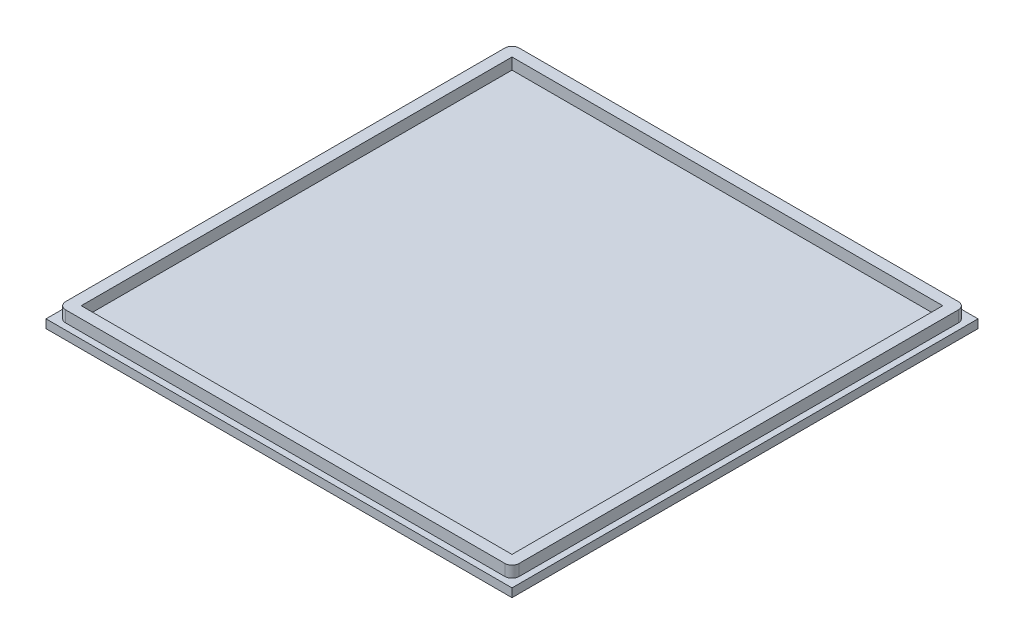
ISO-10303-21;
HEADER;
FILE_DESCRIPTION(('STEP AP214'),'2;1');
FILE_NAME('part.step','',(''),(''),'','','');
FILE_SCHEMA(('AUTOMOTIVE_DESIGN { 1 0 10303 214 1 1 1 1 }'));
ENDSEC;
DATA;
#1=APPLICATION_CONTEXT('core data for automotive mechanical design processes');
#2=APPLICATION_PROTOCOL_DEFINITION('international standard','automotive_design',2000,#1);
#3=PRODUCT_CONTEXT('',#1,'mechanical');
#4=PRODUCT('Part','Part','',(#3));
#5=PRODUCT_RELATED_PRODUCT_CATEGORY('part','',(#4));
#6=PRODUCT_DEFINITION_FORMATION('','',#4);
#7=PRODUCT_DEFINITION_CONTEXT('part definition',#1,'design');
#8=PRODUCT_DEFINITION('design','',#6,#7);
#9=PRODUCT_DEFINITION_SHAPE('','',#8);
#10=(LENGTH_UNIT() NAMED_UNIT(*) SI_UNIT(.MILLI.,.METRE.));
#11=(NAMED_UNIT(*) PLANE_ANGLE_UNIT() SI_UNIT($,.RADIAN.));
#12=(NAMED_UNIT(*) SI_UNIT($,.STERADIAN.) SOLID_ANGLE_UNIT());
#13=UNCERTAINTY_MEASURE_WITH_UNIT(LENGTH_MEASURE(1.E-05),#10,'distance_accuracy_value','');
#14=(GEOMETRIC_REPRESENTATION_CONTEXT(3) GLOBAL_UNCERTAINTY_ASSIGNED_CONTEXT((#13)) GLOBAL_UNIT_ASSIGNED_CONTEXT((#10,
#11,#12)) REPRESENTATION_CONTEXT('',''));
#15=CARTESIAN_POINT('',(0.,0.,0.));
#16=DIRECTION('',(0.,0.,1.));
#17=DIRECTION('',(1.,0.,0.));
#18=AXIS2_PLACEMENT_3D('',#15,#16,#17);
#19=CARTESIAN_POINT('',(0.,3.,0.));
#20=DIRECTION('',(0.,1.,0.));
#21=DIRECTION('',(0.,0.,1.));
#22=AXIS2_PLACEMENT_3D('',#19,#20,#21);
#23=PLANE('',#22);
#24=DIRECTION('',(0.,0.,-1.));
#25=VECTOR('',#24,1.);
#26=CARTESIAN_POINT('',(82.,3.,-82.));
#27=LINE('',#26,#25);
#28=CARTESIAN_POINT('',(82.,3.,82.));
#29=VERTEX_POINT('',#28);
#30=CARTESIAN_POINT('',(82.,3.,-82.));
#31=VERTEX_POINT('',#30);
#32=EDGE_CURVE('E327',#29,#31,#27,.T.);
#33=ORIENTED_EDGE('',*,*,#32,.T.);
#34=DIRECTION('',(-1.,0.,0.));
#35=VECTOR('',#34,1.);
#36=CARTESIAN_POINT('',(-82.,3.,-82.));
#37=LINE('',#36,#35);
#38=CARTESIAN_POINT('',(-82.,3.,-82.));
#39=VERTEX_POINT('',#38);
#40=EDGE_CURVE('E331',#31,#39,#37,.T.);
#41=ORIENTED_EDGE('',*,*,#40,.T.);
#42=DIRECTION('',(0.,0.,1.));
#43=VECTOR('',#42,1.);
#44=CARTESIAN_POINT('',(-82.,3.,-82.));
#45=LINE('',#44,#43);
#46=CARTESIAN_POINT('',(-82.,3.,82.));
#47=VERTEX_POINT('',#46);
#48=EDGE_CURVE('E335',#39,#47,#45,.T.);
#49=ORIENTED_EDGE('',*,*,#48,.T.);
#50=DIRECTION('',(1.,0.,0.));
#51=VECTOR('',#50,1.);
#52=CARTESIAN_POINT('',(-82.,3.,82.));
#53=LINE('',#52,#51);
#54=EDGE_CURVE('E338',#47,#29,#53,.T.);
#55=ORIENTED_EDGE('',*,*,#54,.T.);
#56=EDGE_LOOP('',(#33,#41,#49,#55));
#57=FACE_BOUND('',#56,.T.);
#58=DIRECTION('',(-1.,0.,0.));
#59=VECTOR('',#58,1.);
#60=CARTESIAN_POINT('',(-77.3,3.,-79.8));
#61=LINE('',#60,#59);
#62=CARTESIAN_POINT('',(77.3,3.,-79.8));
#63=VERTEX_POINT('',#62);
#64=CARTESIAN_POINT('',(-77.3,3.,-79.8));
#65=VERTEX_POINT('',#64);
#66=EDGE_CURVE('E278',#63,#65,#61,.T.);
#67=ORIENTED_EDGE('',*,*,#66,.F.);
#68=CARTESIAN_POINT('',(77.3,3.,-77.3));
#69=DIRECTION('',(0.,1.,0.));
#70=DIRECTION('',(0.,0.,1.));
#71=AXIS2_PLACEMENT_3D('',#68,#69,#70);
#72=CIRCLE('',#71,2.5);
#73=CARTESIAN_POINT('',(79.8,3.,-77.3));
#74=VERTEX_POINT('',#73);
#75=EDGE_CURVE('E216',#74,#63,#72,.T.);
#76=ORIENTED_EDGE('',*,*,#75,.F.);
#77=DIRECTION('',(0.,0.,-1.));
#78=VECTOR('',#77,1.);
#79=CARTESIAN_POINT('',(79.8,3.,77.3));
#80=LINE('',#79,#78);
#81=CARTESIAN_POINT('',(79.8,3.,77.3));
#82=VERTEX_POINT('',#81);
#83=EDGE_CURVE('E253',#82,#74,#80,.T.);
#84=ORIENTED_EDGE('',*,*,#83,.F.);
#85=CARTESIAN_POINT('',(77.3,3.,77.3));
#86=DIRECTION('',(0.,1.,0.));
#87=DIRECTION('',(0.,0.,1.));
#88=AXIS2_PLACEMENT_3D('',#85,#86,#87);
#89=CIRCLE('',#88,2.5);
#90=CARTESIAN_POINT('',(77.3,3.,79.8));
#91=VERTEX_POINT('',#90);
#92=EDGE_CURVE('E293',#91,#82,#89,.T.);
#93=ORIENTED_EDGE('',*,*,#92,.F.);
#94=DIRECTION('',(1.,0.,0.));
#95=VECTOR('',#94,1.);
#96=CARTESIAN_POINT('',(-77.3,3.,79.8));
#97=LINE('',#96,#95);
#98=CARTESIAN_POINT('',(-77.3,3.,79.8));
#99=VERTEX_POINT('',#98);
#100=EDGE_CURVE('E290',#99,#91,#97,.T.);
#101=ORIENTED_EDGE('',*,*,#100,.F.);
#102=CARTESIAN_POINT('',(-77.3,3.,77.3));
#103=DIRECTION('',(0.,1.,0.));
#104=DIRECTION('',(0.,0.,1.));
#105=AXIS2_PLACEMENT_3D('',#102,#103,#104);
#106=CIRCLE('',#105,2.50000000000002);
#107=CARTESIAN_POINT('',(-79.8,3.,77.3));
#108=VERTEX_POINT('',#107);
#109=EDGE_CURVE('E287',#108,#99,#106,.T.);
#110=ORIENTED_EDGE('',*,*,#109,.F.);
#111=DIRECTION('',(0.,0.,1.));
#112=VECTOR('',#111,1.);
#113=CARTESIAN_POINT('',(-79.8,3.,77.3));
#114=LINE('',#113,#112);
#115=CARTESIAN_POINT('',(-79.8,3.,-77.3));
#116=VERTEX_POINT('',#115);
#117=EDGE_CURVE('E284',#116,#108,#114,.T.);
#118=ORIENTED_EDGE('',*,*,#117,.F.);
#119=CARTESIAN_POINT('',(-77.3,3.,-77.3));
#120=DIRECTION('',(0.,1.,0.));
#121=DIRECTION('',(0.,0.,1.));
#122=AXIS2_PLACEMENT_3D('',#119,#120,#121);
#123=CIRCLE('',#122,2.5);
#124=EDGE_CURVE('E281',#65,#116,#123,.T.);
#125=ORIENTED_EDGE('',*,*,#124,.F.);
#126=EDGE_LOOP('',(#67,#76,#84,#93,#101,#110,#118,#125));
#127=FACE_BOUND('',#126,.T.);
#128=ADVANCED_FACE('F81',(#57,#127),#23,.T.);
#129=CARTESIAN_POINT('',(82.,3.,-82.));
#130=DIRECTION('',(-1.,0.,0.));
#131=DIRECTION('',(0.,0.,1.));
#132=AXIS2_PLACEMENT_3D('',#129,#130,#131);
#133=PLANE('',#132);
#134=DIRECTION('',(0.,0.,-1.));
#135=VECTOR('',#134,1.);
#136=CARTESIAN_POINT('',(82.,0.,-82.));
#137=LINE('',#136,#135);
#138=CARTESIAN_POINT('',(82.,0.,82.));
#139=VERTEX_POINT('',#138);
#140=CARTESIAN_POINT('',(82.,0.,-82.));
#141=VERTEX_POINT('',#140);
#142=EDGE_CURVE('E326',#139,#141,#137,.T.);
#143=ORIENTED_EDGE('',*,*,#142,.T.);
#144=DIRECTION('',(0.,-1.,0.));
#145=VECTOR('',#144,1.);
#146=CARTESIAN_POINT('',(82.,3.,-82.));
#147=LINE('',#146,#145);
#148=EDGE_CURVE('E12',#31,#141,#147,.T.);
#149=ORIENTED_EDGE('',*,*,#148,.F.);
#150=ORIENTED_EDGE('',*,*,#32,.F.);
#151=DIRECTION('',(0.,-1.,0.));
#152=VECTOR('',#151,1.);
#153=CARTESIAN_POINT('',(82.,3.,82.));
#154=LINE('',#153,#152);
#155=EDGE_CURVE('E341',#29,#139,#154,.T.);
#156=ORIENTED_EDGE('',*,*,#155,.T.);
#157=EDGE_LOOP('',(#143,#149,#150,#156));
#158=FACE_BOUND('',#157,.T.);
#159=ADVANCED_FACE('F83',(#158),#133,.F.);
#160=CARTESIAN_POINT('',(-82.,3.,-82.));
#161=DIRECTION('',(0.,0.,1.));
#162=DIRECTION('',(1.,0.,0.));
#163=AXIS2_PLACEMENT_3D('',#160,#161,#162);
#164=PLANE('',#163);
#165=DIRECTION('',(-1.,0.,0.));
#166=VECTOR('',#165,1.);
#167=CARTESIAN_POINT('',(-82.,0.,-82.));
#168=LINE('',#167,#166);
#169=CARTESIAN_POINT('',(-82.,0.,-82.));
#170=VERTEX_POINT('',#169);
#171=EDGE_CURVE('E345',#141,#170,#168,.T.);
#172=ORIENTED_EDGE('',*,*,#171,.T.);
#173=DIRECTION('',(0.,-1.,0.));
#174=VECTOR('',#173,1.);
#175=CARTESIAN_POINT('',(-82.,3.,-82.));
#176=LINE('',#175,#174);
#177=EDGE_CURVE('E90',#39,#170,#176,.T.);
#178=ORIENTED_EDGE('',*,*,#177,.F.);
#179=ORIENTED_EDGE('',*,*,#40,.F.);
#180=ORIENTED_EDGE('',*,*,#148,.T.);
#181=EDGE_LOOP('',(#172,#178,#179,#180));
#182=FACE_BOUND('',#181,.T.);
#183=ADVANCED_FACE('F381',(#182),#164,.F.);
#184=CARTESIAN_POINT('',(-82.,3.,-82.));
#185=DIRECTION('',(1.,0.,0.));
#186=DIRECTION('',(0.,0.,-1.));
#187=AXIS2_PLACEMENT_3D('',#184,#185,#186);
#188=PLANE('',#187);
#189=DIRECTION('',(0.,0.,1.));
#190=VECTOR('',#189,1.);
#191=CARTESIAN_POINT('',(-82.,0.,-82.));
#192=LINE('',#191,#190);
#193=CARTESIAN_POINT('',(-82.,0.,82.));
#194=VERTEX_POINT('',#193);
#195=EDGE_CURVE('E348',#170,#194,#192,.T.);
#196=ORIENTED_EDGE('',*,*,#195,.T.);
#197=DIRECTION('',(0.,-1.,0.));
#198=VECTOR('',#197,1.);
#199=CARTESIAN_POINT('',(-82.,3.,82.));
#200=LINE('',#199,#198);
#201=EDGE_CURVE('E356',#47,#194,#200,.T.);
#202=ORIENTED_EDGE('',*,*,#201,.F.);
#203=ORIENTED_EDGE('',*,*,#48,.F.);
#204=ORIENTED_EDGE('',*,*,#177,.T.);
#205=EDGE_LOOP('',(#196,#202,#203,#204));
#206=FACE_BOUND('',#205,.T.);
#207=ADVANCED_FACE('F365',(#206),#188,.F.);
#208=CARTESIAN_POINT('',(-82.,3.,82.));
#209=DIRECTION('',(0.,0.,-1.));
#210=DIRECTION('',(-1.,0.,0.));
#211=AXIS2_PLACEMENT_3D('',#208,#209,#210);
#212=PLANE('',#211);
#213=DIRECTION('',(1.,0.,0.));
#214=VECTOR('',#213,1.);
#215=CARTESIAN_POINT('',(-82.,0.,82.));
#216=LINE('',#215,#214);
#217=EDGE_CURVE('E332',#194,#139,#216,.T.);
#218=ORIENTED_EDGE('',*,*,#217,.T.);
#219=ORIENTED_EDGE('',*,*,#155,.F.);
#220=ORIENTED_EDGE('',*,*,#54,.F.);
#221=ORIENTED_EDGE('',*,*,#201,.T.);
#222=EDGE_LOOP('',(#218,#219,#220,#221));
#223=FACE_BOUND('',#222,.T.);
#224=ADVANCED_FACE('F374',(#223),#212,.F.);
#225=CARTESIAN_POINT('',(0.,0.,0.));
#226=DIRECTION('',(0.,1.,0.));
#227=DIRECTION('',(0.,0.,1.));
#228=AXIS2_PLACEMENT_3D('',#225,#226,#227);
#229=PLANE('',#228);
#230=ORIENTED_EDGE('',*,*,#142,.F.);
#231=ORIENTED_EDGE('',*,*,#217,.F.);
#232=ORIENTED_EDGE('',*,*,#195,.F.);
#233=ORIENTED_EDGE('',*,*,#171,.F.);
#234=EDGE_LOOP('',(#230,#231,#232,#233));
#235=FACE_BOUND('',#234,.T.);
#236=ADVANCED_FACE('F371',(#235),#229,.F.);
#237=CARTESIAN_POINT('',(77.3,7.,-77.3));
#238=DIRECTION('',(0.,1.,0.));
#239=DIRECTION('',(0.,0.,1.));
#240=AXIS2_PLACEMENT_3D('',#237,#238,#239);
#241=PLANE('',#240);
#242=CARTESIAN_POINT('',(77.3,7.,-77.3));
#243=DIRECTION('',(0.,1.,0.));
#244=DIRECTION('',(0.,0.,1.));
#245=AXIS2_PLACEMENT_3D('',#242,#243,#244);
#246=CIRCLE('',#245,2.5);
#247=CARTESIAN_POINT('',(79.8,7.,-77.3));
#248=VERTEX_POINT('',#247);
#249=CARTESIAN_POINT('',(77.3,7.,-79.8));
#250=VERTEX_POINT('',#249);
#251=EDGE_CURVE('E248',#248,#250,#246,.T.);
#252=ORIENTED_EDGE('',*,*,#251,.T.);
#253=DIRECTION('',(-1.,0.,0.));
#254=VECTOR('',#253,1.);
#255=CARTESIAN_POINT('',(-77.3,7.,-79.8));
#256=LINE('',#255,#254);
#257=CARTESIAN_POINT('',(-77.3,7.,-79.8));
#258=VERTEX_POINT('',#257);
#259=EDGE_CURVE('E252',#250,#258,#256,.T.);
#260=ORIENTED_EDGE('',*,*,#259,.T.);
#261=CARTESIAN_POINT('',(-77.3,7.,-77.3));
#262=DIRECTION('',(0.,1.,0.));
#263=DIRECTION('',(0.,0.,1.));
#264=AXIS2_PLACEMENT_3D('',#261,#262,#263);
#265=CIRCLE('',#264,2.5);
#266=CARTESIAN_POINT('',(-79.8,7.,-77.3));
#267=VERTEX_POINT('',#266);
#268=EDGE_CURVE('E256',#258,#267,#265,.T.);
#269=ORIENTED_EDGE('',*,*,#268,.T.);
#270=DIRECTION('',(0.,0.,1.));
#271=VECTOR('',#270,1.);
#272=CARTESIAN_POINT('',(-79.8,7.,77.3));
#273=LINE('',#272,#271);
#274=CARTESIAN_POINT('',(-79.8,7.,77.3));
#275=VERTEX_POINT('',#274);
#276=EDGE_CURVE('E259',#267,#275,#273,.T.);
#277=ORIENTED_EDGE('',*,*,#276,.T.);
#278=CARTESIAN_POINT('',(-77.3,7.,77.3));
#279=DIRECTION('',(0.,1.,0.));
#280=DIRECTION('',(0.,0.,1.));
#281=AXIS2_PLACEMENT_3D('',#278,#279,#280);
#282=CIRCLE('',#281,2.50000000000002);
#283=CARTESIAN_POINT('',(-77.3,7.,79.8));
#284=VERTEX_POINT('',#283);
#285=EDGE_CURVE('E262',#275,#284,#282,.T.);
#286=ORIENTED_EDGE('',*,*,#285,.T.);
#287=DIRECTION('',(1.,0.,0.));
#288=VECTOR('',#287,1.);
#289=CARTESIAN_POINT('',(-77.3,7.,79.8));
#290=LINE('',#289,#288);
#291=CARTESIAN_POINT('',(77.3,7.,79.8));
#292=VERTEX_POINT('',#291);
#293=EDGE_CURVE('E265',#284,#292,#290,.T.);
#294=ORIENTED_EDGE('',*,*,#293,.T.);
#295=CARTESIAN_POINT('',(77.3,7.,77.3));
#296=DIRECTION('',(0.,1.,0.));
#297=DIRECTION('',(0.,0.,1.));
#298=AXIS2_PLACEMENT_3D('',#295,#296,#297);
#299=CIRCLE('',#298,2.5);
#300=CARTESIAN_POINT('',(79.8,7.,77.3));
#301=VERTEX_POINT('',#300);
#302=EDGE_CURVE('E268',#292,#301,#299,.T.);
#303=ORIENTED_EDGE('',*,*,#302,.T.);
#304=DIRECTION('',(0.,0.,-1.));
#305=VECTOR('',#304,1.);
#306=CARTESIAN_POINT('',(79.8,7.,77.3));
#307=LINE('',#306,#305);
#308=EDGE_CURVE('E271',#301,#248,#307,.T.);
#309=ORIENTED_EDGE('',*,*,#308,.T.);
#310=EDGE_LOOP('',(#252,#260,#269,#277,#286,#294,#303,#309));
#311=FACE_BOUND('',#310,.T.);
#312=DIRECTION('',(0.,0.,1.));
#313=VECTOR('',#312,1.);
#314=CARTESIAN_POINT('',(-75.8,7.,77.3));
#315=LINE('',#314,#313);
#316=CARTESIAN_POINT('',(-75.8,7.,-75.8));
#317=VERTEX_POINT('',#316);
#318=CARTESIAN_POINT('',(-75.8,7.,75.8));
#319=VERTEX_POINT('',#318);
#320=EDGE_CURVE('E207',#317,#319,#315,.T.);
#321=ORIENTED_EDGE('',*,*,#320,.F.);
#322=DIRECTION('',(-1.,0.,0.));
#323=VECTOR('',#322,1.);
#324=CARTESIAN_POINT('',(-77.3,7.,-75.8));
#325=LINE('',#324,#323);
#326=CARTESIAN_POINT('',(75.8,7.,-75.8));
#327=VERTEX_POINT('',#326);
#328=EDGE_CURVE('E197',#327,#317,#325,.T.);
#329=ORIENTED_EDGE('',*,*,#328,.F.);
#330=DIRECTION('',(0.,0.,-1.));
#331=VECTOR('',#330,1.);
#332=CARTESIAN_POINT('',(75.8,7.,77.3));
#333=LINE('',#332,#331);
#334=CARTESIAN_POINT('',(75.8,7.,75.8));
#335=VERTEX_POINT('',#334);
#336=EDGE_CURVE('E226',#335,#327,#333,.T.);
#337=ORIENTED_EDGE('',*,*,#336,.F.);
#338=DIRECTION('',(1.,0.,0.));
#339=VECTOR('',#338,1.);
#340=CARTESIAN_POINT('',(-77.3,7.,75.8));
#341=LINE('',#340,#339);
#342=EDGE_CURVE('E222',#319,#335,#341,.T.);
#343=ORIENTED_EDGE('',*,*,#342,.F.);
#344=EDGE_LOOP('',(#321,#329,#337,#343));
#345=FACE_BOUND('',#344,.T.);
#346=ADVANCED_FACE('F220',(#311,#345),#241,.T.);
#347=CARTESIAN_POINT('',(77.3,7.,-77.3));
#348=DIRECTION('',(0.,-1.,0.));
#349=DIRECTION('',(0.,0.,-1.));
#350=AXIS2_PLACEMENT_3D('',#347,#348,#349);
#351=CYLINDRICAL_SURFACE('',#350,2.5);
#352=ORIENTED_EDGE('',*,*,#75,.T.);
#353=DIRECTION('',(0.,-1.,0.));
#354=VECTOR('',#353,1.);
#355=CARTESIAN_POINT('',(77.3,7.,-79.8));
#356=LINE('',#355,#354);
#357=EDGE_CURVE('E323',#250,#63,#356,.T.);
#358=ORIENTED_EDGE('',*,*,#357,.F.);
#359=ORIENTED_EDGE('',*,*,#251,.F.);
#360=DIRECTION('',(0.,-1.,0.));
#361=VECTOR('',#360,1.);
#362=CARTESIAN_POINT('',(79.8,7.,-77.3));
#363=LINE('',#362,#361);
#364=EDGE_CURVE('E274',#248,#74,#363,.T.);
#365=ORIENTED_EDGE('',*,*,#364,.T.);
#366=EDGE_LOOP('',(#352,#358,#359,#365));
#367=FACE_BOUND('',#366,.T.);
#368=ADVANCED_FACE('F418',(#367),#351,.T.);
#369=CARTESIAN_POINT('',(-77.3,7.,-79.8));
#370=DIRECTION('',(0.,0.,1.));
#371=DIRECTION('',(1.,0.,0.));
#372=AXIS2_PLACEMENT_3D('',#369,#370,#371);
#373=PLANE('',#372);
#374=ORIENTED_EDGE('',*,*,#66,.T.);
#375=DIRECTION('',(0.,-1.,0.));
#376=VECTOR('',#375,1.);
#377=CARTESIAN_POINT('',(-77.3,7.,-79.8));
#378=LINE('',#377,#376);
#379=EDGE_CURVE('E319',#258,#65,#378,.T.);
#380=ORIENTED_EDGE('',*,*,#379,.F.);
#381=ORIENTED_EDGE('',*,*,#259,.F.);
#382=ORIENTED_EDGE('',*,*,#357,.T.);
#383=EDGE_LOOP('',(#374,#380,#381,#382));
#384=FACE_BOUND('',#383,.T.);
#385=ADVANCED_FACE('F441',(#384),#373,.F.);
#386=CARTESIAN_POINT('',(-77.3,7.,-77.3));
#387=DIRECTION('',(0.,-1.,0.));
#388=DIRECTION('',(0.,0.,-1.));
#389=AXIS2_PLACEMENT_3D('',#386,#387,#388);
#390=CYLINDRICAL_SURFACE('',#389,2.5);
#391=ORIENTED_EDGE('',*,*,#124,.T.);
#392=DIRECTION('',(0.,-1.,0.));
#393=VECTOR('',#392,1.);
#394=CARTESIAN_POINT('',(-79.8,7.,-77.3));
#395=LINE('',#394,#393);
#396=EDGE_CURVE('E315',#267,#116,#395,.T.);
#397=ORIENTED_EDGE('',*,*,#396,.F.);
#398=ORIENTED_EDGE('',*,*,#268,.F.);
#399=ORIENTED_EDGE('',*,*,#379,.T.);
#400=EDGE_LOOP('',(#391,#397,#398,#399));
#401=FACE_BOUND('',#400,.T.);
#402=ADVANCED_FACE('F437',(#401),#390,.T.);
#403=CARTESIAN_POINT('',(-79.8,7.,77.3));
#404=DIRECTION('',(1.,0.,0.));
#405=DIRECTION('',(0.,0.,-1.));
#406=AXIS2_PLACEMENT_3D('',#403,#404,#405);
#407=PLANE('',#406);
#408=ORIENTED_EDGE('',*,*,#117,.T.);
#409=DIRECTION('',(0.,-1.,0.));
#410=VECTOR('',#409,1.);
#411=CARTESIAN_POINT('',(-79.8,7.,77.3));
#412=LINE('',#411,#410);
#413=EDGE_CURVE('E311',#275,#108,#412,.T.);
#414=ORIENTED_EDGE('',*,*,#413,.F.);
#415=ORIENTED_EDGE('',*,*,#276,.F.);
#416=ORIENTED_EDGE('',*,*,#396,.T.);
#417=EDGE_LOOP('',(#408,#414,#415,#416));
#418=FACE_BOUND('',#417,.T.);
#419=ADVANCED_FACE('F433',(#418),#407,.F.);
#420=CARTESIAN_POINT('',(-77.3,7.,77.3));
#421=DIRECTION('',(0.,-1.,0.));
#422=DIRECTION('',(0.,0.,-1.));
#423=AXIS2_PLACEMENT_3D('',#420,#421,#422);
#424=CYLINDRICAL_SURFACE('',#423,2.50000000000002);
#425=ORIENTED_EDGE('',*,*,#109,.T.);
#426=DIRECTION('',(0.,-1.,0.));
#427=VECTOR('',#426,1.);
#428=CARTESIAN_POINT('',(-77.3,7.,79.8));
#429=LINE('',#428,#427);
#430=EDGE_CURVE('E307',#284,#99,#429,.T.);
#431=ORIENTED_EDGE('',*,*,#430,.F.);
#432=ORIENTED_EDGE('',*,*,#285,.F.);
#433=ORIENTED_EDGE('',*,*,#413,.T.);
#434=EDGE_LOOP('',(#425,#431,#432,#433));
#435=FACE_BOUND('',#434,.T.);
#436=ADVANCED_FACE('F429',(#435),#424,.T.);
#437=CARTESIAN_POINT('',(-77.3,7.,79.8));
#438=DIRECTION('',(0.,0.,-1.));
#439=DIRECTION('',(-1.,0.,0.));
#440=AXIS2_PLACEMENT_3D('',#437,#438,#439);
#441=PLANE('',#440);
#442=ORIENTED_EDGE('',*,*,#100,.T.);
#443=DIRECTION('',(0.,-1.,0.));
#444=VECTOR('',#443,1.);
#445=CARTESIAN_POINT('',(77.3,7.,79.8));
#446=LINE('',#445,#444);
#447=EDGE_CURVE('E303',#292,#91,#446,.T.);
#448=ORIENTED_EDGE('',*,*,#447,.F.);
#449=ORIENTED_EDGE('',*,*,#293,.F.);
#450=ORIENTED_EDGE('',*,*,#430,.T.);
#451=EDGE_LOOP('',(#442,#448,#449,#450));
#452=FACE_BOUND('',#451,.T.);
#453=ADVANCED_FACE('F425',(#452),#441,.F.);
#454=CARTESIAN_POINT('',(77.3,7.,77.3));
#455=DIRECTION('',(0.,-1.,0.));
#456=DIRECTION('',(0.,0.,-1.));
#457=AXIS2_PLACEMENT_3D('',#454,#455,#456);
#458=CYLINDRICAL_SURFACE('',#457,2.5);
#459=ORIENTED_EDGE('',*,*,#92,.T.);
#460=DIRECTION('',(0.,-1.,0.));
#461=VECTOR('',#460,1.);
#462=CARTESIAN_POINT('',(79.8,7.,77.3));
#463=LINE('',#462,#461);
#464=EDGE_CURVE('E97',#301,#82,#463,.T.);
#465=ORIENTED_EDGE('',*,*,#464,.F.);
#466=ORIENTED_EDGE('',*,*,#302,.F.);
#467=ORIENTED_EDGE('',*,*,#447,.T.);
#468=EDGE_LOOP('',(#459,#465,#466,#467));
#469=FACE_BOUND('',#468,.T.);
#470=ADVANCED_FACE('F422',(#469),#458,.T.);
#471=CARTESIAN_POINT('',(79.8,7.,77.3));
#472=DIRECTION('',(-1.,0.,0.));
#473=DIRECTION('',(0.,0.,1.));
#474=AXIS2_PLACEMENT_3D('',#471,#472,#473);
#475=PLANE('',#474);
#476=ORIENTED_EDGE('',*,*,#83,.T.);
#477=ORIENTED_EDGE('',*,*,#364,.F.);
#478=ORIENTED_EDGE('',*,*,#308,.F.);
#479=ORIENTED_EDGE('',*,*,#464,.T.);
#480=EDGE_LOOP('',(#476,#477,#478,#479));
#481=FACE_BOUND('',#480,.T.);
#482=ADVANCED_FACE('F416',(#481),#475,.F.);
#483=CARTESIAN_POINT('',(-77.3,7.,-75.8));
#484=DIRECTION('',(0.,0.,1.));
#485=DIRECTION('',(1.,0.,0.));
#486=AXIS2_PLACEMENT_3D('',#483,#484,#485);
#487=PLANE('',#486);
#488=DIRECTION('',(-1.,0.,0.));
#489=VECTOR('',#488,1.);
#490=CARTESIAN_POINT('',(-77.3,3.,-75.8));
#491=LINE('',#490,#489);
#492=CARTESIAN_POINT('',(75.8,3.,-75.8));
#493=VERTEX_POINT('',#492);
#494=CARTESIAN_POINT('',(-75.8,3.,-75.8));
#495=VERTEX_POINT('',#494);
#496=EDGE_CURVE('E105',#493,#495,#491,.T.);
#497=ORIENTED_EDGE('',*,*,#496,.F.);
#498=DIRECTION('',(0.,-1.,0.));
#499=VECTOR('',#498,1.);
#500=CARTESIAN_POINT('',(75.8,7.,-75.8));
#501=LINE('',#500,#499);
#502=EDGE_CURVE('E202',#327,#493,#501,.T.);
#503=ORIENTED_EDGE('',*,*,#502,.F.);
#504=ORIENTED_EDGE('',*,*,#328,.T.);
#505=DIRECTION('',(0.,-1.,0.));
#506=VECTOR('',#505,1.);
#507=CARTESIAN_POINT('',(-75.8,7.,-75.8));
#508=LINE('',#507,#506);
#509=EDGE_CURVE('E200',#317,#495,#508,.T.);
#510=ORIENTED_EDGE('',*,*,#509,.T.);
#511=EDGE_LOOP('',(#497,#503,#504,#510));
#512=FACE_BOUND('',#511,.T.);
#513=ADVANCED_FACE('F199',(#512),#487,.T.);
#514=CARTESIAN_POINT('',(-75.8,7.,77.3));
#515=DIRECTION('',(1.,0.,0.));
#516=DIRECTION('',(0.,0.,-1.));
#517=AXIS2_PLACEMENT_3D('',#514,#515,#516);
#518=PLANE('',#517);
#519=DIRECTION('',(0.,0.,1.));
#520=VECTOR('',#519,1.);
#521=CARTESIAN_POINT('',(-75.8,3.,77.3));
#522=LINE('',#521,#520);
#523=CARTESIAN_POINT('',(-75.8,3.,75.8));
#524=VERTEX_POINT('',#523);
#525=EDGE_CURVE('E214',#495,#524,#522,.T.);
#526=ORIENTED_EDGE('',*,*,#525,.F.);
#527=ORIENTED_EDGE('',*,*,#509,.F.);
#528=ORIENTED_EDGE('',*,*,#320,.T.);
#529=DIRECTION('',(0.,-1.,0.));
#530=VECTOR('',#529,1.);
#531=CARTESIAN_POINT('',(-75.8,7.,75.8));
#532=LINE('',#531,#530);
#533=EDGE_CURVE('E217',#319,#524,#532,.T.);
#534=ORIENTED_EDGE('',*,*,#533,.T.);
#535=EDGE_LOOP('',(#526,#527,#528,#534));
#536=FACE_BOUND('',#535,.T.);
#537=ADVANCED_FACE('F211',(#536),#518,.T.);
#538=CARTESIAN_POINT('',(-77.3,7.,75.8));
#539=DIRECTION('',(0.,0.,-1.));
#540=DIRECTION('',(-1.,0.,0.));
#541=AXIS2_PLACEMENT_3D('',#538,#539,#540);
#542=PLANE('',#541);
#543=DIRECTION('',(1.,0.,0.));
#544=VECTOR('',#543,1.);
#545=CARTESIAN_POINT('',(-77.3,3.,75.8));
#546=LINE('',#545,#544);
#547=CARTESIAN_POINT('',(75.8,3.,75.8));
#548=VERTEX_POINT('',#547);
#549=EDGE_CURVE('E235',#524,#548,#546,.T.);
#550=ORIENTED_EDGE('',*,*,#549,.F.);
#551=ORIENTED_EDGE('',*,*,#533,.F.);
#552=ORIENTED_EDGE('',*,*,#342,.T.);
#553=DIRECTION('',(0.,-1.,0.));
#554=VECTOR('',#553,1.);
#555=CARTESIAN_POINT('',(75.8,7.,75.8));
#556=LINE('',#555,#554);
#557=EDGE_CURVE('E242',#335,#548,#556,.T.);
#558=ORIENTED_EDGE('',*,*,#557,.T.);
#559=EDGE_LOOP('',(#550,#551,#552,#558));
#560=FACE_BOUND('',#559,.T.);
#561=ADVANCED_FACE('F402',(#560),#542,.T.);
#562=CARTESIAN_POINT('',(75.8,7.,77.3));
#563=DIRECTION('',(-1.,0.,0.));
#564=DIRECTION('',(0.,0.,1.));
#565=AXIS2_PLACEMENT_3D('',#562,#563,#564);
#566=PLANE('',#565);
#567=DIRECTION('',(0.,0.,-1.));
#568=VECTOR('',#567,1.);
#569=CARTESIAN_POINT('',(75.8,3.,77.3));
#570=LINE('',#569,#568);
#571=EDGE_CURVE('E208',#548,#493,#570,.T.);
#572=ORIENTED_EDGE('',*,*,#571,.F.);
#573=ORIENTED_EDGE('',*,*,#557,.F.);
#574=ORIENTED_EDGE('',*,*,#336,.T.);
#575=ORIENTED_EDGE('',*,*,#502,.T.);
#576=EDGE_LOOP('',(#572,#573,#574,#575));
#577=FACE_BOUND('',#576,.T.);
#578=ADVANCED_FACE('F398',(#577),#566,.T.);
#579=ORIENTED_EDGE('',*,*,#496,.T.);
#580=ORIENTED_EDGE('',*,*,#525,.T.);
#581=ORIENTED_EDGE('',*,*,#549,.T.);
#582=ORIENTED_EDGE('',*,*,#571,.T.);
#583=EDGE_LOOP('',(#579,#580,#581,#582));
#584=FACE_BOUND('',#583,.T.);
#585=ADVANCED_FACE('F390',(#584),#23,.T.);
#586=CLOSED_SHELL('',(#128,#159,#183,#207,#224,#236,#346,#368,#385,#402,#419,#436,#453,#470,
#482,#513,#537,#561,#578,#585));
#587=MANIFOLD_SOLID_BREP('B2',#586);
#588=ADVANCED_BREP_SHAPE_REPRESENTATION('',(#18,#587),#14);
#589=SHAPE_DEFINITION_REPRESENTATION(#9,#588);
ENDSEC;
END-ISO-10303-21;
